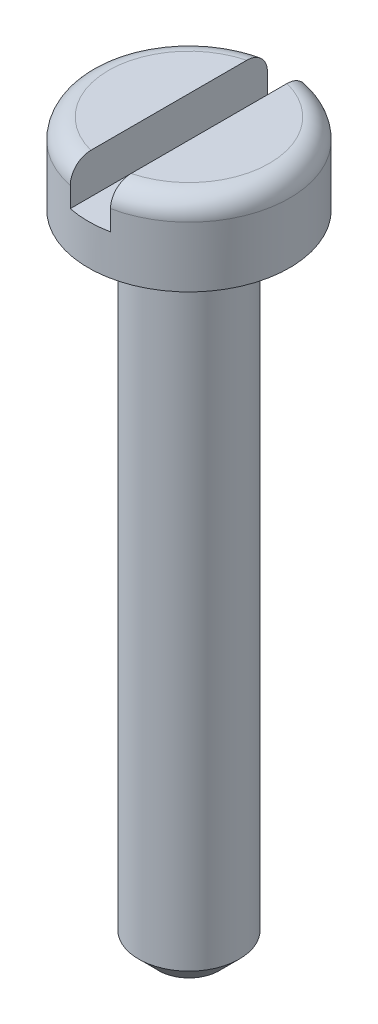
ISO-10303-21;
HEADER;
FILE_DESCRIPTION(('STEP AP214'),'2;1');
FILE_NAME('part.step','',(''),(''),'','','');
FILE_SCHEMA(('AUTOMOTIVE_DESIGN { 1 0 10303 214 1 1 1 1 }'));
ENDSEC;
DATA;
#1=APPLICATION_CONTEXT('core data for automotive mechanical design processes');
#2=APPLICATION_PROTOCOL_DEFINITION('international standard','automotive_design',2000,#1);
#3=PRODUCT_CONTEXT('',#1,'mechanical');
#4=PRODUCT('Part','Part','',(#3));
#5=PRODUCT_RELATED_PRODUCT_CATEGORY('part','',(#4));
#6=PRODUCT_DEFINITION_FORMATION('','',#4);
#7=PRODUCT_DEFINITION_CONTEXT('part definition',#1,'design');
#8=PRODUCT_DEFINITION('design','',#6,#7);
#9=PRODUCT_DEFINITION_SHAPE('','',#8);
#10=(LENGTH_UNIT() NAMED_UNIT(*) SI_UNIT(.MILLI.,.METRE.));
#11=(NAMED_UNIT(*) PLANE_ANGLE_UNIT() SI_UNIT($,.RADIAN.));
#12=(NAMED_UNIT(*) SI_UNIT($,.STERADIAN.) SOLID_ANGLE_UNIT());
#13=UNCERTAINTY_MEASURE_WITH_UNIT(LENGTH_MEASURE(1.E-05),#10,'distance_accuracy_value','');
#14=(GEOMETRIC_REPRESENTATION_CONTEXT(3) GLOBAL_UNCERTAINTY_ASSIGNED_CONTEXT((#13)) GLOBAL_UNIT_ASSIGNED_CONTEXT((#10,
#11,#12)) REPRESENTATION_CONTEXT('',''));
#15=CARTESIAN_POINT('',(0.,0.,0.));
#16=DIRECTION('',(0.,0.,1.));
#17=DIRECTION('',(1.,0.,0.));
#18=AXIS2_PLACEMENT_3D('',#15,#16,#17);
#19=CARTESIAN_POINT('',(0.,18.,0.));
#20=DIRECTION('',(0.,1.,0.));
#21=DIRECTION('',(0.,0.,1.));
#22=AXIS2_PLACEMENT_3D('',#19,#20,#21);
#23=PLANE('',#22);
#24=DIRECTION('',(0.,0.,-1.));
#25=VECTOR('',#24,1.);
#26=CARTESIAN_POINT('',(0.500000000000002,18.,0.));
#27=LINE('',#26,#25);
#28=CARTESIAN_POINT('',(0.500000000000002,18.,1.93649167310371));
#29=VERTEX_POINT('',#28);
#30=CARTESIAN_POINT('',(0.500000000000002,18.,-1.93649167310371));
#31=VERTEX_POINT('',#30);
#32=EDGE_CURVE('E143',#29,#31,#27,.T.);
#33=ORIENTED_EDGE('',*,*,#32,.F.);
#34=CARTESIAN_POINT('',(0.,18.,0.));
#35=DIRECTION('',(0.,-1.,0.));
#36=DIRECTION('',(0.,0.,-1.));
#37=AXIS2_PLACEMENT_3D('',#34,#35,#36);
#38=CIRCLE('',#37,2.);
#39=EDGE_CURVE('E124',#31,#29,#38,.T.);
#40=ORIENTED_EDGE('',*,*,#39,.F.);
#41=EDGE_LOOP('',(#33,#40));
#42=FACE_BOUND('',#41,.T.);
#43=ADVANCED_FACE('F41',(#42),#23,.T.);
#44=CARTESIAN_POINT('',(0.,17.5,0.));
#45=DIRECTION('',(0.,-1.,0.));
#46=DIRECTION('',(0.,0.,-1.));
#47=AXIS2_PLACEMENT_3D('',#44,#45,#46);
#48=TOROIDAL_SURFACE('',#47,2.,0.5);
#49=CARTESIAN_POINT('',(0.500000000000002,17.6513555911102,-2.42554244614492));
#50=CARTESIAN_POINT('',(0.500000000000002,17.6251453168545,-2.43404091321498));
#51=CARTESIAN_POINT('',(0.500000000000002,17.5982013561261,-2.44033899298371));
#52=CARTESIAN_POINT('',(0.500000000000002,17.5436171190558,-2.44832431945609));
#53=CARTESIAN_POINT('',(0.500000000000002,17.5159761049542,-2.45000645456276));
#54=CARTESIAN_POINT('',(0.500000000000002,17.4608140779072,-2.44869809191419));
#55=CARTESIAN_POINT('',(0.500000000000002,17.4332930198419,-2.44570953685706));
#56=CARTESIAN_POINT('',(0.500000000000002,17.3791505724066,-2.43515649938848));
#57=CARTESIAN_POINT('',(0.500000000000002,17.3525289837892,-2.42759303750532));
#58=CARTESIAN_POINT('',(0.500000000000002,17.3009074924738,-2.40811846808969));
#59=CARTESIAN_POINT('',(0.500000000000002,17.2759086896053,-2.39620444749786));
#60=CARTESIAN_POINT('',(0.500000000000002,17.228236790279,-2.36839135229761));
#61=CARTESIAN_POINT('',(0.500000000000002,17.2055638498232,-2.35249201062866));
#62=CARTESIAN_POINT('',(0.500000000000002,17.1629136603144,-2.31698765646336));
#63=CARTESIAN_POINT('',(0.500000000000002,17.1429684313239,-2.29734420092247));
#64=CARTESIAN_POINT('',(0.500000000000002,17.1065821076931,-2.25504509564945));
#65=CARTESIAN_POINT('',(0.500000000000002,17.090141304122,-2.23238919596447));
#66=CARTESIAN_POINT('',(0.500000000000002,17.0608734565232,-2.18423384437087));
#67=CARTESIAN_POINT('',(0.500000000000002,17.0481246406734,-2.15868686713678));
#68=CARTESIAN_POINT('',(0.500000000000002,17.0269779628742,-2.10585286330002));
#69=CARTESIAN_POINT('',(0.500000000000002,17.0185806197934,-2.0785656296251));
#70=CARTESIAN_POINT('',(0.500000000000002,17.0061505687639,-2.02229237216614));
#71=CARTESIAN_POINT('',(0.500000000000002,17.0022332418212,-1.99328086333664));
#72=CARTESIAN_POINT('',(0.500000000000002,16.9992028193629,-1.93500802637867));
#73=CARTESIAN_POINT('',(0.500000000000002,17.0000903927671,-1.90574666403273));
#74=CARTESIAN_POINT('',(0.500000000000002,17.0066876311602,-1.84706981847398));
#75=CARTESIAN_POINT('',(0.500000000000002,17.0125109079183,-1.81766707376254));
#76=CARTESIAN_POINT('',(0.500000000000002,17.0289558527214,-1.76023287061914));
#77=CARTESIAN_POINT('',(0.500000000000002,17.03957807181,-1.73220157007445));
#78=CARTESIAN_POINT('',(0.500000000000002,17.0654836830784,-1.67801317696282));
#79=CARTESIAN_POINT('',(0.500000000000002,17.0808151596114,-1.65187902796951));
#80=CARTESIAN_POINT('',(0.500000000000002,17.1157152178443,-1.60260565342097));
#81=CARTESIAN_POINT('',(0.500000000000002,17.1352837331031,-1.57946638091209));
#82=CARTESIAN_POINT('',(0.500000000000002,17.1778084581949,-1.5372947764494));
#83=CARTESIAN_POINT('',(0.500000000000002,17.2007043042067,-1.51820169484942));
#84=CARTESIAN_POINT('',(0.500000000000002,17.2495050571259,-1.48434893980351));
#85=CARTESIAN_POINT('',(0.500000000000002,17.2754090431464,-1.46958794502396));
#86=CARTESIAN_POINT('',(0.500000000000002,17.3282283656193,-1.44556869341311));
#87=CARTESIAN_POINT('',(0.500000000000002,17.3550431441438,-1.4360894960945));
#88=CARTESIAN_POINT('',(0.500000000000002,17.4099262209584,-1.42203172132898));
#89=CARTESIAN_POINT('',(0.500000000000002,17.4379940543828,-1.41745134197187));
#90=CARTESIAN_POINT('',(0.500000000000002,17.4931051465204,-1.41349529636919));
#91=CARTESIAN_POINT('',(0.500000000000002,17.5201311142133,-1.4138753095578));
#92=CARTESIAN_POINT('',(0.500000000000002,17.5737207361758,-1.41923295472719));
#93=CARTESIAN_POINT('',(0.500000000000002,17.6002844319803,-1.42421017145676));
#94=CARTESIAN_POINT('',(0.500000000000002,17.6518652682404,-1.43846589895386));
#95=CARTESIAN_POINT('',(0.500000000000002,17.6768976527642,-1.44768955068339));
#96=CARTESIAN_POINT('',(0.500000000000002,17.7251311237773,-1.47007613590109));
#97=CARTESIAN_POINT('',(0.500000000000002,17.7483319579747,-1.48323961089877));
#98=CARTESIAN_POINT('',(0.500000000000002,17.7930866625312,-1.51356498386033));
#99=CARTESIAN_POINT('',(0.500000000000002,17.8145603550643,-1.53084504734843));
#100=CARTESIAN_POINT('',(0.500000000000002,17.8544807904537,-1.56860345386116));
#101=CARTESIAN_POINT('',(0.500000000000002,17.8729268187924,-1.58908254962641));
#102=CARTESIAN_POINT('',(0.500000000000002,17.9072539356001,-1.63378495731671));
#103=CARTESIAN_POINT('',(0.500000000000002,17.9229554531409,-1.65814624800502));
#104=CARTESIAN_POINT('',(0.500000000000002,17.9502153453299,-1.70908672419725));
#105=CARTESIAN_POINT('',(0.500000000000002,17.9617728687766,-1.73566636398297));
#106=CARTESIAN_POINT('',(0.500000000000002,17.9808087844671,-1.79133272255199));
#107=CARTESIAN_POINT('',(0.500000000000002,17.9881238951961,-1.82047542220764));
#108=CARTESIAN_POINT('',(0.500000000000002,17.9977993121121,-1.87957393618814));
#109=CARTESIAN_POINT('',(0.500000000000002,18.0001592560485,-1.90952980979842));
#110=CARTESIAN_POINT('',(0.500000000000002,17.9998228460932,-1.96963605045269));
#111=CARTESIAN_POINT('',(0.500000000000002,17.9970893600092,-1.99978623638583));
#112=CARTESIAN_POINT('',(0.500000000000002,17.9865160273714,-2.05917846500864));
#113=CARTESIAN_POINT('',(0.500000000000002,17.9786767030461,-2.08842060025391));
#114=CARTESIAN_POINT('',(0.500000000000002,17.9582254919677,-2.14465744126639));
#115=CARTESIAN_POINT('',(0.500000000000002,17.9456919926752,-2.17168062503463));
#116=CARTESIAN_POINT('',(0.500000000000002,17.9161464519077,-2.22316837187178));
#117=CARTESIAN_POINT('',(0.500000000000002,17.8991338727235,-2.24763262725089));
#118=CARTESIAN_POINT('',(0.500000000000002,17.8615769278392,-2.29263724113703));
#119=CARTESIAN_POINT('',(0.500000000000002,17.8411322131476,-2.31326085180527));
#120=CARTESIAN_POINT('',(0.500000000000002,17.7970099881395,-2.35065625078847));
#121=CARTESIAN_POINT('',(0.500000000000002,17.7733370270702,-2.3674333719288));
#122=CARTESIAN_POINT('',(0.500000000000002,17.7330711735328,-2.39098922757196));
#123=CARTESIAN_POINT('',(0.500000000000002,17.7172595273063,-2.39913103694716));
#124=CARTESIAN_POINT('',(0.500000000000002,17.6848521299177,-2.41366766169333));
#125=CARTESIAN_POINT('',(0.500000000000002,17.6682563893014,-2.42006250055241));
#126=CARTESIAN_POINT('',(0.500000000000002,17.6513555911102,-2.42554244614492));
#127=B_SPLINE_CURVE_WITH_KNOTS('',3,(#49,#50,#51,#52,#53,#54,#55,#56,#57,#58,#59,#60,#61,#62,
#63,#64,#65,#66,#67,#68,#69,#70,#71,#72,#73,#74,#75,#76,#77,#78,#79,#80,#81,#82,#83,#84,#85,#86,
#87,#88,#89,#90,#91,#92,#93,#94,#95,#96,#97,#98,#99,#100,#101,#102,#103,#104,#105,#106,#107,
#108,#109,#110,#111,#112,#113,#114,#115,#116,#117,#118,#119,#120,#121,#122,#123,#124,#125,#126),
.UNSPECIFIED.,.T.,.F.,(4,2,2,2,2,2,2,2,2,2,2,2,2,2,2,2,2,2,2,2,2,2,2,2,2,2,2,2,2,2,2,2,2,2,2,2,
2,2,4),(0.,0.0825962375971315,0.165283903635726,0.247937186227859,0.330572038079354,
0.413262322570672,0.495958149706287,0.579553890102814,0.66315657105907,0.748419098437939,
0.833691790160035,0.921114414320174,1.00854920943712,1.09805303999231,1.18756715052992,
1.27802747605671,1.36848638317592,1.4574720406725,1.54643052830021,1.63131732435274,
1.71617288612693,1.79686540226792,1.87755063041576,1.95722154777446,2.03690342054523,
2.11922887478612,2.20157372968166,2.28813262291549,2.37470928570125,2.46442832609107,
2.55415392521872,2.64453620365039,2.73490923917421,2.82383595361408,2.91277334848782,
2.99947263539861,3.08605098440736,3.13931105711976,3.19257041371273),.UNSPECIFIED.);
#128=CARTESIAN_POINT('',(0.500000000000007,17.5,-2.44948974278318));
#129=VERTEX_POINT('',#128);
#130=EDGE_CURVE('E159',#31,#129,#127,.T.);
#131=ORIENTED_EDGE('',*,*,#130,.F.);
#132=ORIENTED_EDGE('',*,*,#39,.T.);
#133=CARTESIAN_POINT('',(0.500000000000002,17.6189418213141,1.42942839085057));
#134=CARTESIAN_POINT('',(0.500000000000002,17.5931610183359,1.42274049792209));
#135=CARTESIAN_POINT('',(0.500000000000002,17.5668035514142,1.41820976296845));
#136=CARTESIAN_POINT('',(0.500000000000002,17.5136858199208,1.41365847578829));
#137=CARTESIAN_POINT('',(0.500000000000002,17.4869252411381,1.41364164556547));
#138=CARTESIAN_POINT('',(0.500000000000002,17.4338001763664,1.41812335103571));
#139=CARTESIAN_POINT('',(0.500000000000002,17.4074354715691,1.42261929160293));
#140=CARTESIAN_POINT('',(0.500000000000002,17.3558307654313,1.43593989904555));
#141=CARTESIAN_POINT('',(0.500000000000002,17.330590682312,1.44476425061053));
#142=CARTESIAN_POINT('',(0.500000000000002,17.2816932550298,1.46649754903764));
#143=CARTESIAN_POINT('',(0.500000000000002,17.2580505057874,1.47943923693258));
#144=CARTESIAN_POINT('',(0.500000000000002,17.2131448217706,1.50894112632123));
#145=CARTESIAN_POINT('',(0.500000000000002,17.1918823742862,1.52550206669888));
#146=CARTESIAN_POINT('',(0.500000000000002,17.1512964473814,1.56257318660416));
#147=CARTESIAN_POINT('',(0.500000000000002,17.1321066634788,1.58322968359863));
#148=CARTESIAN_POINT('',(0.500000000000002,17.0972742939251,1.62734311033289));
#149=CARTESIAN_POINT('',(0.500000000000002,17.0816325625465,1.65080071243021));
#150=CARTESIAN_POINT('',(0.500000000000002,17.0535847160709,1.70105988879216));
#151=CARTESIAN_POINT('',(0.500000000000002,17.0413685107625,1.72796759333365));
#152=CARTESIAN_POINT('',(0.500000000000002,17.0215061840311,1.78342124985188));
#153=CARTESIAN_POINT('',(0.500000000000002,17.0138607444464,1.81196744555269));
#154=CARTESIAN_POINT('',(0.500000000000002,17.0032240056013,1.87061301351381));
#155=CARTESIAN_POINT('',(0.500000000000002,17.0003465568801,1.90073313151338));
#156=CARTESIAN_POINT('',(0.500000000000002,16.999712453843,1.96102931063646));
#157=CARTESIAN_POINT('',(0.500000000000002,17.0019558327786,1.99120537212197));
#158=CARTESIAN_POINT('',(0.500000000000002,17.0115295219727,2.05059786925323));
#159=CARTESIAN_POINT('',(0.500000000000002,17.0188360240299,2.07981812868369));
#160=CARTESIAN_POINT('',(0.500000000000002,17.038361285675,2.13657054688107));
#161=CARTESIAN_POINT('',(0.500000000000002,17.0505795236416,2.16410288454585));
#162=CARTESIAN_POINT('',(0.500000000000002,17.0793048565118,2.21604366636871));
#163=CARTESIAN_POINT('',(0.500000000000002,17.095711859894,2.24050744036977));
#164=CARTESIAN_POINT('',(0.500000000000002,17.1325028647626,2.28623679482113));
#165=CARTESIAN_POINT('',(0.500000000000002,17.1528862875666,2.30750283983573));
#166=CARTESIAN_POINT('',(0.500000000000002,17.1964758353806,2.34564438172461));
#167=CARTESIAN_POINT('',(0.500000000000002,17.2195943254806,2.36262005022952));
#168=CARTESIAN_POINT('',(0.500000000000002,17.2684036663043,2.39234871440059));
#169=CARTESIAN_POINT('',(0.500000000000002,17.2940941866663,2.40510225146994));
#170=CARTESIAN_POINT('',(0.500000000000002,17.3467238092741,2.4257496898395));
#171=CARTESIAN_POINT('',(0.500000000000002,17.3736244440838,2.43374171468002));
#172=CARTESIAN_POINT('',(0.500000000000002,17.4283928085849,2.44503342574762));
#173=CARTESIAN_POINT('',(0.500000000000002,17.4562604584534,2.44833349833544));
#174=CARTESIAN_POINT('',(0.500000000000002,17.5118069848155,2.45012555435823));
#175=CARTESIAN_POINT('',(0.500000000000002,17.5394839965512,2.44867589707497));
#176=CARTESIAN_POINT('',(0.500000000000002,17.5941990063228,2.44114230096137));
#177=CARTESIAN_POINT('',(0.500000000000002,17.6212370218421,2.4350584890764));
#178=CARTESIAN_POINT('',(0.500000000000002,17.6738704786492,2.41845817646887));
#179=CARTESIAN_POINT('',(0.500000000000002,17.6994680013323,2.40794826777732));
#180=CARTESIAN_POINT('',(0.500000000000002,17.7485572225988,2.38281792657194));
#181=CARTESIAN_POINT('',(0.500000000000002,17.7720488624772,2.36819737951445));
#182=CARTESIAN_POINT('',(0.500000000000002,17.8165017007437,2.335130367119));
#183=CARTESIAN_POINT('',(0.500000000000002,17.8374375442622,2.31664983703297));
#184=CARTESIAN_POINT('',(0.500000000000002,17.8759779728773,2.27649378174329));
#185=CARTESIAN_POINT('',(0.500000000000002,17.8935823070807,2.25481801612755));
#186=CARTESIAN_POINT('',(0.500000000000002,17.9253182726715,2.20846407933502));
#187=CARTESIAN_POINT('',(0.500000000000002,17.9393793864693,2.18373765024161));
#188=CARTESIAN_POINT('',(0.500000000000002,17.9632646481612,2.13231806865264));
#189=CARTESIAN_POINT('',(0.500000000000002,17.9730882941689,2.10562468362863));
#190=CARTESIAN_POINT('',(0.500000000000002,17.9884795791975,2.05032684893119));
#191=CARTESIAN_POINT('',(0.500000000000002,17.993936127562,2.02169148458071));
#192=CARTESIAN_POINT('',(0.500000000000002,18.0000899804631,1.96391417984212));
#193=CARTESIAN_POINT('',(0.500000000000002,18.0007866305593,1.93477217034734));
#194=CARTESIAN_POINT('',(0.500000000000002,17.9974023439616,1.87604638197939));
#195=CARTESIAN_POINT('',(0.500000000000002,17.9932034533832,1.84646937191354));
#196=CARTESIAN_POINT('',(0.500000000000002,17.9799712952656,1.78841624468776));
#197=CARTESIAN_POINT('',(0.500000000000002,17.9709376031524,1.75994022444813));
#198=CARTESIAN_POINT('',(0.500000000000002,17.9481208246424,1.7045019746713));
#199=CARTESIAN_POINT('',(0.500000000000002,17.9342748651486,1.67756557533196));
#200=CARTESIAN_POINT('',(0.500000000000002,17.9022060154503,1.62642153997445));
#201=CARTESIAN_POINT('',(0.500000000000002,17.8839819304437,1.60221465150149));
#202=CARTESIAN_POINT('',(0.500000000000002,17.8438367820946,1.5575516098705));
#203=CARTESIAN_POINT('',(0.500000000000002,17.8219570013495,1.5370583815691));
#204=CARTESIAN_POINT('',(0.500000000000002,17.7749553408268,1.50025028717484));
#205=CARTESIAN_POINT('',(0.500000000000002,17.74983855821,1.48392896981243));
#206=CARTESIAN_POINT('',(0.500000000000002,17.7069050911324,1.46126815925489));
#207=CARTESIAN_POINT('',(0.500000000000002,17.6898420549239,1.45347281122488));
#208=CARTESIAN_POINT('',(0.500000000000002,17.6549283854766,1.43990533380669));
#209=CARTESIAN_POINT('',(0.500000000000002,17.6370777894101,1.43413310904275));
#210=CARTESIAN_POINT('',(0.500000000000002,17.6189418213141,1.42942839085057));
#211=B_SPLINE_CURVE_WITH_KNOTS('',3,(#133,#134,#135,#136,#137,#138,#139,#140,#141,#142,#143,
#144,#145,#146,#147,#148,#149,#150,#151,#152,#153,#154,#155,#156,#157,#158,#159,#160,#161,#162,
#163,#164,#165,#166,#167,#168,#169,#170,#171,#172,#173,#174,#175,#176,#177,#178,#179,#180,#181,
#182,#183,#184,#185,#186,#187,#188,#189,#190,#191,#192,#193,#194,#195,#196,#197,#198,#199,#200,
#201,#202,#203,#204,#205,#206,#207,#208,#209,#210),.UNSPECIFIED.,.T.,.F.,(4,2,2,2,2,2,2,2,2,2,2,
2,2,2,2,2,2,2,2,2,2,2,2,2,2,2,2,2,2,2,2,2,2,2,2,2,2,2,4),(0.,0.0798347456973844,
0.159735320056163,0.239589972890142,0.319438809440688,0.3999391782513,0.480455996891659,
0.564666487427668,0.64889723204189,0.737145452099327,0.82540683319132,0.915746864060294,
1.00608748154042,1.09600614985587,1.18591527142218,1.27384968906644,1.36177131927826,
1.44739645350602,1.53301060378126,1.61679324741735,1.70056899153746,1.78331927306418,
1.86606728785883,1.94869249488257,2.03132000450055,2.11471009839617,2.19810646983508,
2.28305067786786,2.368004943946,2.45505711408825,2.54212125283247,2.63132723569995,
2.72054105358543,2.81096723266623,2.90141811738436,2.99090918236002,3.08026101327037,
3.13642484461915,3.19258602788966),.UNSPECIFIED.);
#212=CARTESIAN_POINT('',(0.500000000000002,17.5,2.44948974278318));
#213=VERTEX_POINT('',#212);
#214=EDGE_CURVE('E136',#213,#29,#211,.T.);
#215=ORIENTED_EDGE('',*,*,#214,.F.);
#216=CARTESIAN_POINT('',(0.,17.5,0.));
#217=DIRECTION('',(0.,-1.,0.));
#218=DIRECTION('',(0.,0.,-1.));
#219=AXIS2_PLACEMENT_3D('',#216,#217,#218);
#220=CIRCLE('',#219,2.5);
#221=EDGE_CURVE('E129',#129,#213,#220,.T.);
#222=ORIENTED_EDGE('',*,*,#221,.F.);
#223=EDGE_LOOP('',(#131,#132,#215,#222));
#224=FACE_BOUND('',#223,.T.);
#225=ADVANCED_FACE('F191',(#224),#48,.T.);
#226=CARTESIAN_POINT('',(0.,0.,-1.25));
#227=DIRECTION('',(0.,-1.,0.));
#228=DIRECTION('',(0.,0.,-1.));
#229=AXIS2_PLACEMENT_3D('',#226,#227,#228);
#230=PLANE('',#229);
#231=CARTESIAN_POINT('',(0.,0.,0.));
#232=DIRECTION('',(0.,-1.,0.));
#233=DIRECTION('',(0.,0.,-1.));
#234=AXIS2_PLACEMENT_3D('',#231,#232,#233);
#235=CIRCLE('',#234,0.750000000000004);
#236=CARTESIAN_POINT('',(0.,0.,-0.750000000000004));
#237=VERTEX_POINT('',#236);
#238=EDGE_CURVE('E49',#237,#237,#235,.T.);
#239=ORIENTED_EDGE('',*,*,#238,.T.);
#240=EDGE_LOOP('',(#239));
#241=FACE_BOUND('',#240,.T.);
#242=ADVANCED_FACE('F186',(#241),#230,.T.);
#243=DIRECTION('',(0.,0.,1.));
#244=VECTOR('',#243,1.);
#245=CARTESIAN_POINT('',(-0.499999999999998,18.,0.));
#246=LINE('',#245,#244);
#247=CARTESIAN_POINT('',(-0.499999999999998,18.,-1.93649167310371));
#248=VERTEX_POINT('',#247);
#249=CARTESIAN_POINT('',(-0.499999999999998,18.,1.93649167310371));
#250=VERTEX_POINT('',#249);
#251=EDGE_CURVE('E169',#248,#250,#246,.T.);
#252=ORIENTED_EDGE('',*,*,#251,.F.);
#253=EDGE_CURVE('E127',#250,#248,#38,.T.);
#254=ORIENTED_EDGE('',*,*,#253,.F.);
#255=EDGE_LOOP('',(#252,#254));
#256=FACE_BOUND('',#255,.T.);
#257=ADVANCED_FACE('F184',(#256),#23,.T.);
#258=CARTESIAN_POINT('',(-0.499999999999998,17.6513555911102,-2.42554244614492));
#259=CARTESIAN_POINT('',(-0.499999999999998,17.6779604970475,-2.41691326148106));
#260=CARTESIAN_POINT('',(-0.499999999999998,17.7038492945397,-2.40600355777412));
#261=CARTESIAN_POINT('',(-0.499999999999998,17.7534356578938,-2.3799605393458));
#262=CARTESIAN_POINT('',(-0.499999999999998,17.7771302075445,-2.36482152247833));
#263=CARTESIAN_POINT('',(-0.499999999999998,17.8216230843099,-2.33081077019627));
#264=CARTESIAN_POINT('',(-0.499999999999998,17.8424249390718,-2.3119436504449));
#265=CARTESIAN_POINT('',(-0.499999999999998,17.8806119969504,-2.2710349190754));
#266=CARTESIAN_POINT('',(-0.499999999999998,17.8979980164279,-2.24899406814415));
#267=CARTESIAN_POINT('',(-0.499999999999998,17.9291508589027,-2.2020382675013));
#268=CARTESIAN_POINT('',(-0.499999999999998,17.9428630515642,-2.17708709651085));
#269=CARTESIAN_POINT('',(-0.499999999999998,17.9660199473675,-2.12527750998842));
#270=CARTESIAN_POINT('',(-0.499999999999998,17.9754639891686,-2.09841879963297));
#271=CARTESIAN_POINT('',(-0.499999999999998,17.9900668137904,-2.04284531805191));
#272=CARTESIAN_POINT('',(-0.499999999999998,17.9951130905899,-2.0141009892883));
#273=CARTESIAN_POINT('',(-0.499999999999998,18.0004331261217,-1.95617429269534));
#274=CARTESIAN_POINT('',(-0.499999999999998,18.0007062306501,-1.92699186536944));
#275=CARTESIAN_POINT('',(-0.499999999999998,17.9964614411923,-1.86826143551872));
#276=CARTESIAN_POINT('',(-0.499999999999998,17.9918266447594,-1.83872185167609));
#277=CARTESIAN_POINT('',(-0.499999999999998,17.977730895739,-1.78081534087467));
#278=CARTESIAN_POINT('',(-0.499999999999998,17.9682693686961,-1.75244855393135));
#279=CARTESIAN_POINT('',(-0.499999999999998,17.9446164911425,-1.69732230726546));
#280=CARTESIAN_POINT('',(-0.499999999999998,17.9303656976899,-1.67058830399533));
#281=CARTESIAN_POINT('',(-0.499999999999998,17.8975257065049,-1.61992661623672));
#282=CARTESIAN_POINT('',(-0.499999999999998,17.8789364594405,-1.59599896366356));
#283=CARTESIAN_POINT('',(-0.499999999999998,17.8381466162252,-1.55199874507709));
#284=CARTESIAN_POINT('',(-0.499999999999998,17.8159940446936,-1.53188174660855));
#285=CARTESIAN_POINT('',(-0.499999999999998,17.768496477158,-1.49585115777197));
#286=CARTESIAN_POINT('',(-0.499999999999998,17.743152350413,-1.47993642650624));
#287=CARTESIAN_POINT('',(-0.499999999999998,17.6911443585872,-1.45352942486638));
#288=CARTESIAN_POINT('',(-0.499999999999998,17.6645840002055,-1.44283353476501));
#289=CARTESIAN_POINT('',(-0.499999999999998,17.6099878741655,-1.42632621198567));
#290=CARTESIAN_POINT('',(-0.499999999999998,17.5819526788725,-1.4205128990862));
#291=CARTESIAN_POINT('',(-0.499999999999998,17.5267405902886,-1.41419640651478));
#292=CARTESIAN_POINT('',(-0.499999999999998,17.4995926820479,-1.41343791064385));
#293=CARTESIAN_POINT('',(-0.499999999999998,17.4455711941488,-1.41658506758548));
#294=CARTESIAN_POINT('',(-0.499999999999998,17.4186975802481,-1.42049013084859));
#295=CARTESIAN_POINT('',(-0.499999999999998,17.3664917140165,-1.43268529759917));
#296=CARTESIAN_POINT('',(-0.499999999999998,17.3411402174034,-1.44089354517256));
#297=CARTESIAN_POINT('',(-0.499999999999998,17.2921175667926,-1.4613330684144));
#298=CARTESIAN_POINT('',(-0.499999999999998,17.2684466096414,-1.47356481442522));
#299=CARTESIAN_POINT('',(-0.499999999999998,17.2227080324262,-1.50203777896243));
#300=CARTESIAN_POINT('',(-0.499999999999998,17.2007057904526,-1.5183838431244));
#301=CARTESIAN_POINT('',(-0.499999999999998,17.1595873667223,-1.55437114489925));
#302=CARTESIAN_POINT('',(-0.499999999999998,17.1404718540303,-1.57401314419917));
#303=CARTESIAN_POINT('',(-0.499999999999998,17.1046462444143,-1.61710863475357));
#304=CARTESIAN_POINT('',(-0.499999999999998,17.0881083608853,-1.64070534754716));
#305=CARTESIAN_POINT('',(-0.499999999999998,17.059050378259,-1.69025542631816));
#306=CARTESIAN_POINT('',(-0.499999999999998,17.046531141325,-1.71620929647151));
#307=CARTESIAN_POINT('',(-0.499999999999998,17.0253938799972,-1.77084081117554));
#308=CARTESIAN_POINT('',(-0.499999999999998,17.0169485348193,-1.79958541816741));
#309=CARTESIAN_POINT('',(-0.499999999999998,17.0049437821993,-1.85807915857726));
#310=CARTESIAN_POINT('',(-0.499999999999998,17.0013848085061,-1.88782838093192));
#311=CARTESIAN_POINT('',(-0.499999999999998,16.9992680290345,-1.94782921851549));
#312=CARTESIAN_POINT('',(-0.499999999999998,17.0007645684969,-1.97808279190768));
#313=CARTESIAN_POINT('',(-0.499999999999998,17.0088881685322,-2.03789526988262));
#314=CARTESIAN_POINT('',(-0.499999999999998,17.015514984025,-2.06745420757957));
#315=CARTESIAN_POINT('',(-0.499999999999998,17.0336407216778,-2.12459213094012));
#316=CARTESIAN_POINT('',(-0.499999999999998,17.0450711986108,-2.15219279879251));
#317=CARTESIAN_POINT('',(-0.499999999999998,17.0725203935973,-2.20501148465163));
#318=CARTESIAN_POINT('',(-0.499999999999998,17.0885385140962,-2.23022981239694));
#319=CARTESIAN_POINT('',(-0.499999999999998,17.1242785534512,-2.27688718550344));
#320=CARTESIAN_POINT('',(-0.499999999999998,17.1438972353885,-2.29840530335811));
#321=CARTESIAN_POINT('',(-0.499999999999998,17.1865501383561,-2.33773708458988));
#322=CARTESIAN_POINT('',(-0.499999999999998,17.209583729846,-2.35555142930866));
#323=CARTESIAN_POINT('',(-0.499999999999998,17.2577891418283,-2.38650628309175));
#324=CARTESIAN_POINT('',(-0.499999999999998,17.2828931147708,-2.39975249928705));
#325=CARTESIAN_POINT('',(-0.499999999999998,17.3350048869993,-2.421757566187));
#326=CARTESIAN_POINT('',(-0.499999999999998,17.3620129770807,-2.43051572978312));
#327=CARTESIAN_POINT('',(-0.499999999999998,17.4166512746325,-2.44314746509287));
#328=CARTESIAN_POINT('',(-0.499999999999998,17.4442626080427,-2.44710300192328));
#329=CARTESIAN_POINT('',(-0.499999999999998,17.4997314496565,-2.45027454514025));
#330=CARTESIAN_POINT('',(-0.499999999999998,17.5275885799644,-2.44949687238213));
#331=CARTESIAN_POINT('',(-0.499999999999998,17.5714906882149,-2.44452556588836));
#332=CARTESIAN_POINT('',(-0.499999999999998,17.5877226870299,-2.44185328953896));
#333=CARTESIAN_POINT('',(-0.499999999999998,17.619837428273,-2.43489736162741));
#334=CARTESIAN_POINT('',(-0.499999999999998,17.6357201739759,-2.43061372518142));
#335=CARTESIAN_POINT('',(-0.499999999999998,17.6513555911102,-2.42554244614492));
#336=B_SPLINE_CURVE_WITH_KNOTS('',3,(#258,#259,#260,#261,#262,#263,#264,#265,#266,#267,#268,
#269,#270,#271,#272,#273,#274,#275,#276,#277,#278,#279,#280,#281,#282,#283,#284,#285,#286,#287,
#288,#289,#290,#291,#292,#293,#294,#295,#296,#297,#298,#299,#300,#301,#302,#303,#304,#305,#306,
#307,#308,#309,#310,#311,#312,#313,#314,#315,#316,#317,#318,#319,#320,#321,#322,#323,#324,#325,
#326,#327,#328,#329,#330,#331,#332,#333,#334,#335),.UNSPECIFIED.,.T.,.F.,(4,2,2,2,2,2,2,2,2,2,2,
2,2,2,2,2,2,2,2,2,2,2,2,2,2,2,2,2,2,2,2,2,2,2,2,2,2,2,4),(0.,0.0838467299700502,
0.167807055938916,0.251664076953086,0.33550103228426,0.420523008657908,0.505558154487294,
0.592709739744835,0.679873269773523,0.76916067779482,0.858458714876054,0.948908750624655,
1.03935981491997,1.12868072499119,1.21797735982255,1.30343687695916,1.3888634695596,
1.469940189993,1.5510066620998,1.63058421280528,1.71017106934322,1.79203843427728,
1.87392474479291,1.95998382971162,2.04606136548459,2.13552220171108,2.22499097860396,
2.31542456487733,2.40585383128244,2.49503610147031,2.5842067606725,2.67113567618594,
2.75804858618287,2.84278878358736,2.9275419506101,3.0108273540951,3.09400156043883,
3.1432778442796,3.1925536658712),.UNSPECIFIED.);
#337=CARTESIAN_POINT('',(-0.499999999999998,17.5000000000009,-2.44948974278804));
#338=VERTEX_POINT('',#337);
#339=EDGE_CURVE('E164',#338,#248,#336,.T.);
#340=ORIENTED_EDGE('',*,*,#339,.F.);
#341=CARTESIAN_POINT('',(-0.499999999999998,17.5,2.44948974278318));
#342=VERTEX_POINT('',#341);
#343=EDGE_CURVE('E117',#342,#338,#220,.T.);
#344=ORIENTED_EDGE('',*,*,#343,.F.);
#345=CARTESIAN_POINT('',(-0.499999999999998,17.6189418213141,1.42942839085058));
#346=CARTESIAN_POINT('',(-0.499999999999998,17.6459100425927,1.43642736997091));
#347=CARTESIAN_POINT('',(-0.499999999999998,17.6722886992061,1.44579852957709));
#348=CARTESIAN_POINT('',(-0.499999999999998,17.7230869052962,1.4689093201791));
#349=CARTESIAN_POINT('',(-0.499999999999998,17.7475030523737,1.48265634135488));
#350=CARTESIAN_POINT('',(-0.499999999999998,17.7936508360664,1.51396906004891));
#351=CARTESIAN_POINT('',(-0.499999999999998,17.8153893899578,1.53152457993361));
#352=CARTESIAN_POINT('',(-0.499999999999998,17.8557389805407,1.56990371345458));
#353=CARTESIAN_POINT('',(-0.499999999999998,17.8743506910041,1.59072662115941));
#354=CARTESIAN_POINT('',(-0.499999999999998,17.9086879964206,1.63589093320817));
#355=CARTESIAN_POINT('',(-0.499999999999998,17.924277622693,1.66033571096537));
#356=CARTESIAN_POINT('',(-0.499999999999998,17.9513021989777,1.71142528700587));
#357=CARTESIAN_POINT('',(-0.499999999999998,17.9627361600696,1.73807060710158));
#358=CARTESIAN_POINT('',(-0.499999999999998,17.9815092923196,1.7938482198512));
#359=CARTESIAN_POINT('',(-0.499999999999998,17.9886850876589,1.82303564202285));
#360=CARTESIAN_POINT('',(-0.499999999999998,17.9980741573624,1.88220004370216));
#361=CARTESIAN_POINT('',(-0.499999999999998,18.0002870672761,1.91217708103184));
#362=CARTESIAN_POINT('',(-0.499999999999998,17.9996511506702,1.97228726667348));
#363=CARTESIAN_POINT('',(-0.499999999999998,17.9967674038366,2.00242007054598));
#364=CARTESIAN_POINT('',(-0.499999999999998,17.9858973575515,2.06175279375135));
#365=CARTESIAN_POINT('',(-0.499999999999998,17.9779114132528,2.09095277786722));
#366=CARTESIAN_POINT('',(-0.499999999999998,17.9571783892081,2.1470770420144));
#367=CARTESIAN_POINT('',(-0.499999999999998,17.9445102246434,2.17403044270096));
#368=CARTESIAN_POINT('',(-0.499999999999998,17.9147132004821,2.22534898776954));
#369=CARTESIAN_POINT('',(-0.499999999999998,17.8975849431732,2.24971448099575));
#370=CARTESIAN_POINT('',(-0.499999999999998,17.859826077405,2.29449498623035));
#371=CARTESIAN_POINT('',(-0.499999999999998,17.8392967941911,2.31499543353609));
#372=CARTESIAN_POINT('',(-0.499999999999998,17.7950130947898,2.35215380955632));
#373=CARTESIAN_POINT('',(-0.499999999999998,17.7712591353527,2.36881228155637));
#374=CARTESIAN_POINT('',(-0.499999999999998,17.7218238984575,2.3973947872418));
#375=CARTESIAN_POINT('',(-0.499999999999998,17.6962032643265,2.40942375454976));
#376=CARTESIAN_POINT('',(-0.499999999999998,17.6432833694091,2.42892677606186));
#377=CARTESIAN_POINT('',(-0.499999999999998,17.6159842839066,2.43640130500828));
#378=CARTESIAN_POINT('',(-0.499999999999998,17.5609693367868,2.44647100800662));
#379=CARTESIAN_POINT('',(-0.499999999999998,17.5332678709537,2.44914496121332));
#380=CARTESIAN_POINT('',(-0.499999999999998,17.4778122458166,2.44977187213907));
#381=CARTESIAN_POINT('',(-0.499999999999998,17.4500580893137,2.44772507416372));
#382=CARTESIAN_POINT('',(-0.499999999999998,17.3954665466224,2.43900293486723));
#383=CARTESIAN_POINT('',(-0.499999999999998,17.3686245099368,2.43235664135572));
#384=CARTESIAN_POINT('',(-0.499999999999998,17.3164298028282,2.4146720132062));
#385=CARTESIAN_POINT('',(-0.499999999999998,17.2910771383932,2.40363366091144));
#386=CARTESIAN_POINT('',(-0.499999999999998,17.2424457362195,2.37743999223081));
#387=CARTESIAN_POINT('',(-0.499999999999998,17.2191771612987,2.36226582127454));
#388=CARTESIAN_POINT('',(-0.499999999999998,17.1754710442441,2.32827930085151));
#389=CARTESIAN_POINT('',(-0.499999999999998,17.1550336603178,2.3094667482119));
#390=CARTESIAN_POINT('',(-0.499999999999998,17.1172374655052,2.26845102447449));
#391=CARTESIAN_POINT('',(-0.499999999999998,17.099928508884,2.24620193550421));
#392=CARTESIAN_POINT('',(-0.499999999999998,17.0691955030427,2.19916712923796));
#393=CARTESIAN_POINT('',(-0.499999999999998,17.0557718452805,2.17438115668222));
#394=CARTESIAN_POINT('',(-0.499999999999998,17.0328614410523,2.12238244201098));
#395=CARTESIAN_POINT('',(-0.499999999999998,17.0234703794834,2.09512755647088));
#396=CARTESIAN_POINT('',(-0.499999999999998,17.0092703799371,2.03945013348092));
#397=CARTESIAN_POINT('',(-0.499999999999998,17.0044620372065,2.0110274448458));
#398=CARTESIAN_POINT('',(-0.499999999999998,16.9994401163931,1.95304352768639));
#399=CARTESIAN_POINT('',(-0.499999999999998,16.999347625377,1.92347180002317));
#400=CARTESIAN_POINT('',(-0.499999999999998,17.0040239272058,1.86471436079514));
#401=CARTESIAN_POINT('',(-0.499999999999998,17.0087933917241,1.83552870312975));
#402=CARTESIAN_POINT('',(-0.499999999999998,17.0231909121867,1.77775562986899));
#403=CARTESIAN_POINT('',(-0.499999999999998,17.0329146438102,1.74919200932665));
#404=CARTESIAN_POINT('',(-0.499999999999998,17.0570103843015,1.6940933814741));
#405=CARTESIAN_POINT('',(-0.499999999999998,17.071382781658,1.6675585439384));
#406=CARTESIAN_POINT('',(-0.499999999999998,17.1044389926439,1.61726810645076));
#407=CARTESIAN_POINT('',(-0.499999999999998,17.1231286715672,1.59351635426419));
#408=CARTESIAN_POINT('',(-0.499999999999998,17.1643378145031,1.54960174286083));
#409=CARTESIAN_POINT('',(-0.499999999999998,17.1868566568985,1.5294383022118));
#410=CARTESIAN_POINT('',(-0.499999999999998,17.2344162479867,1.49395414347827));
#411=CARTESIAN_POINT('',(-0.499999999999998,17.2593641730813,1.4785092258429));
#412=CARTESIAN_POINT('',(-0.499999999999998,17.3116144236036,1.45229033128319));
#413=CARTESIAN_POINT('',(-0.499999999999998,17.3389164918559,1.44151584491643));
#414=CARTESIAN_POINT('',(-0.499999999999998,17.3935793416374,1.42553509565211));
#415=CARTESIAN_POINT('',(-0.499999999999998,17.4208650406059,1.42007119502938));
#416=CARTESIAN_POINT('',(-0.499999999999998,17.4759447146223,1.41401748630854));
#417=CARTESIAN_POINT('',(-0.499999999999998,17.5037377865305,1.41341973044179));
#418=CARTESIAN_POINT('',(-0.499999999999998,17.5461254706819,1.4162401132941));
#419=CARTESIAN_POINT('',(-0.499999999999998,17.5608555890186,1.41792224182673));
#420=CARTESIAN_POINT('',(-0.499999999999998,17.5900933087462,1.4226554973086));
#421=CARTESIAN_POINT('',(-0.499999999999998,17.6046009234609,1.42570654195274));
#422=CARTESIAN_POINT('',(-0.499999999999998,17.6189418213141,1.42942839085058));
#423=B_SPLINE_CURVE_WITH_KNOTS('',3,(#345,#346,#347,#348,#349,#350,#351,#352,#353,#354,#355,
#356,#357,#358,#359,#360,#361,#362,#363,#364,#365,#366,#367,#368,#369,#370,#371,#372,#373,#374,
#375,#376,#377,#378,#379,#380,#381,#382,#383,#384,#385,#386,#387,#388,#389,#390,#391,#392,#393,
#394,#395,#396,#397,#398,#399,#400,#401,#402,#403,#404,#405,#406,#407,#408,#409,#410,#411,#412,
#413,#414,#415,#416,#417,#418,#419,#420,#421,#422),.UNSPECIFIED.,.T.,.F.,(4,2,2,2,2,2,2,2,2,2,2,
2,2,2,2,2,2,2,2,2,2,2,2,2,2,2,2,2,2,2,2,2,2,2,2,2,2,2,4),(0.,0.0835273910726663,
0.167196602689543,0.25064491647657,0.334075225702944,0.420664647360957,0.507274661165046,
0.597022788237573,0.6867775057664,0.777149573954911,0.86751535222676,0.956422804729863,
1.04531825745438,1.13192906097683,1.21852760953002,1.30302791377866,1.38751940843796,
1.47061123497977,1.55369876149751,1.63626628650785,1.71883414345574,1.80178489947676,
1.8847402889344,1.96891924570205,2.05310668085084,2.13919405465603,2.22529260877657,
2.31360079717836,2.40192118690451,2.49201577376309,2.58211789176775,2.6723431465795,
2.76255376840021,2.85013062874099,2.93769793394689,3.02076630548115,3.10369897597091,
3.14811902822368,3.19253641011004),.UNSPECIFIED.);
#424=EDGE_CURVE('E56',#250,#342,#423,.T.);
#425=ORIENTED_EDGE('',*,*,#424,.F.);
#426=ORIENTED_EDGE('',*,*,#253,.T.);
#427=EDGE_LOOP('',(#340,#344,#425,#426));
#428=FACE_BOUND('',#427,.T.);
#429=ADVANCED_FACE('F145',(#428),#48,.T.);
#430=CARTESIAN_POINT('',(0.,0.,0.));
#431=DIRECTION('',(0.,-1.,0.));
#432=DIRECTION('',(0.,0.,-1.));
#433=AXIS2_PLACEMENT_3D('',#430,#431,#432);
#434=CYLINDRICAL_SURFACE('',#433,2.5);
#435=DIRECTION('',(0.,-1.,0.));
#436=VECTOR('',#435,1.);
#437=CARTESIAN_POINT('',(-0.499999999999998,0.,-2.44948974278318));
#438=LINE('',#437,#436);
#439=CARTESIAN_POINT('',(-0.499999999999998,17.,-2.44948974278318));
#440=VERTEX_POINT('',#439);
#441=EDGE_CURVE('E109',#440,#338,#438,.F.);
#442=ORIENTED_EDGE('',*,*,#441,.F.);
#443=CARTESIAN_POINT('',(0.,17.,0.));
#444=DIRECTION('',(0.,-1.,0.));
#445=DIRECTION('',(0.,0.,-1.));
#446=AXIS2_PLACEMENT_3D('',#443,#444,#445);
#447=CIRCLE('',#446,2.5);
#448=CARTESIAN_POINT('',(0.500000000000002,17.,-2.44948974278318));
#449=VERTEX_POINT('',#448);
#450=EDGE_CURVE('E97',#449,#440,#447,.F.);
#451=ORIENTED_EDGE('',*,*,#450,.F.);
#452=DIRECTION('',(0.,-1.,0.));
#453=VECTOR('',#452,1.);
#454=CARTESIAN_POINT('',(0.500000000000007,0.,-2.44948974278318));
#455=LINE('',#454,#453);
#456=EDGE_CURVE('E105',#129,#449,#455,.T.);
#457=ORIENTED_EDGE('',*,*,#456,.F.);
#458=ORIENTED_EDGE('',*,*,#221,.T.);
#459=DIRECTION('',(0.,-1.,0.));
#460=VECTOR('',#459,1.);
#461=CARTESIAN_POINT('',(0.500000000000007,0.,2.44948974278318));
#462=LINE('',#461,#460);
#463=CARTESIAN_POINT('',(0.500000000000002,17.,2.44948974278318));
#464=VERTEX_POINT('',#463);
#465=EDGE_CURVE('E64',#464,#213,#462,.F.);
#466=ORIENTED_EDGE('',*,*,#465,.F.);
#467=CARTESIAN_POINT('',(-0.499999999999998,17.,2.44948974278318));
#468=VERTEX_POINT('',#467);
#469=EDGE_CURVE('E107',#468,#464,#447,.F.);
#470=ORIENTED_EDGE('',*,*,#469,.F.);
#471=DIRECTION('',(0.,-1.,0.));
#472=VECTOR('',#471,1.);
#473=CARTESIAN_POINT('',(-0.499999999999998,0.,2.44948974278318));
#474=LINE('',#473,#472);
#475=EDGE_CURVE('E111',#342,#468,#474,.T.);
#476=ORIENTED_EDGE('',*,*,#475,.F.);
#477=ORIENTED_EDGE('',*,*,#343,.T.);
#478=EDGE_LOOP('',(#442,#451,#457,#458,#466,#470,#476,#477));
#479=FACE_BOUND('',#478,.T.);
#480=CARTESIAN_POINT('',(0.,16.,0.));
#481=DIRECTION('',(0.,-1.,0.));
#482=DIRECTION('',(0.,0.,-1.));
#483=AXIS2_PLACEMENT_3D('',#480,#481,#482);
#484=CIRCLE('',#483,2.5);
#485=CARTESIAN_POINT('',(0.,16.,-2.5));
#486=VERTEX_POINT('',#485);
#487=EDGE_CURVE('E130',#486,#486,#484,.T.);
#488=ORIENTED_EDGE('',*,*,#487,.F.);
#489=EDGE_LOOP('',(#488));
#490=FACE_BOUND('',#489,.T.);
#491=ADVANCED_FACE('F114',(#479,#490),#434,.T.);
#492=CARTESIAN_POINT('',(0.,16.,-2.5));
#493=DIRECTION('',(0.,-1.,0.));
#494=DIRECTION('',(0.,0.,-1.));
#495=AXIS2_PLACEMENT_3D('',#492,#493,#494);
#496=PLANE('',#495);
#497=ORIENTED_EDGE('',*,*,#487,.T.);
#498=EDGE_LOOP('',(#497));
#499=FACE_BOUND('',#498,.T.);
#500=CARTESIAN_POINT('',(0.,16.,0.));
#501=DIRECTION('',(0.,-1.,0.));
#502=DIRECTION('',(0.,0.,-1.));
#503=AXIS2_PLACEMENT_3D('',#500,#501,#502);
#504=CIRCLE('',#503,1.25);
#505=CARTESIAN_POINT('',(0.,16.,-1.25));
#506=VERTEX_POINT('',#505);
#507=EDGE_CURVE('E133',#506,#506,#504,.T.);
#508=ORIENTED_EDGE('',*,*,#507,.F.);
#509=EDGE_LOOP('',(#508));
#510=FACE_BOUND('',#509,.T.);
#511=ADVANCED_FACE('F234',(#499,#510),#496,.T.);
#512=CARTESIAN_POINT('',(0.,0.,0.));
#513=DIRECTION('',(0.,-1.,0.));
#514=DIRECTION('',(0.,0.,-1.));
#515=AXIS2_PLACEMENT_3D('',#512,#513,#514);
#516=CYLINDRICAL_SURFACE('',#515,1.25);
#517=CARTESIAN_POINT('',(0.,0.499999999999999,0.));
#518=DIRECTION('',(0.,-1.,0.));
#519=DIRECTION('',(0.,0.,-1.));
#520=AXIS2_PLACEMENT_3D('',#517,#518,#519);
#521=CIRCLE('',#520,1.25);
#522=CARTESIAN_POINT('',(0.,0.499999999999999,-1.25));
#523=VERTEX_POINT('',#522);
#524=EDGE_CURVE('E11',#523,#523,#521,.F.);
#525=ORIENTED_EDGE('',*,*,#524,.T.);
#526=EDGE_LOOP('',(#525));
#527=FACE_BOUND('',#526,.T.);
#528=ORIENTED_EDGE('',*,*,#507,.T.);
#529=EDGE_LOOP('',(#528));
#530=FACE_BOUND('',#529,.T.);
#531=ADVANCED_FACE('F154',(#527,#530),#516,.T.);
#532=CARTESIAN_POINT('',(0.500000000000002,19.,-2.5));
#533=DIRECTION('',(1.,0.,0.));
#534=DIRECTION('',(0.,1.,0.));
#535=AXIS2_PLACEMENT_3D('',#532,#533,#534);
#536=PLANE('',#535);
#537=ORIENTED_EDGE('',*,*,#465,.T.);
#538=ORIENTED_EDGE('',*,*,#214,.T.);
#539=ORIENTED_EDGE('',*,*,#32,.T.);
#540=ORIENTED_EDGE('',*,*,#130,.T.);
#541=ORIENTED_EDGE('',*,*,#456,.T.);
#542=DIRECTION('',(0.,0.,1.));
#543=VECTOR('',#542,1.);
#544=CARTESIAN_POINT('',(0.500000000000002,17.,-2.5));
#545=LINE('',#544,#543);
#546=EDGE_CURVE('E101',#449,#464,#545,.T.);
#547=ORIENTED_EDGE('',*,*,#546,.T.);
#548=EDGE_LOOP('',(#537,#538,#539,#540,#541,#547));
#549=FACE_BOUND('',#548,.T.);
#550=ADVANCED_FACE('F149',(#549),#536,.F.);
#551=CARTESIAN_POINT('',(-0.499999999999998,17.,-2.5));
#552=DIRECTION('',(0.,-1.,0.));
#553=DIRECTION('',(0.,0.,-1.));
#554=AXIS2_PLACEMENT_3D('',#551,#552,#553);
#555=PLANE('',#554);
#556=DIRECTION('',(0.,0.,1.));
#557=VECTOR('',#556,1.);
#558=CARTESIAN_POINT('',(-0.499999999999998,17.,-2.5));
#559=LINE('',#558,#557);
#560=EDGE_CURVE('E100',#440,#468,#559,.T.);
#561=ORIENTED_EDGE('',*,*,#560,.T.);
#562=ORIENTED_EDGE('',*,*,#469,.T.);
#563=ORIENTED_EDGE('',*,*,#546,.F.);
#564=ORIENTED_EDGE('',*,*,#450,.T.);
#565=EDGE_LOOP('',(#561,#562,#563,#564));
#566=FACE_BOUND('',#565,.T.);
#567=ADVANCED_FACE('F99',(#566),#555,.F.);
#568=CARTESIAN_POINT('',(-0.499999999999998,19.,-2.5));
#569=DIRECTION('',(-1.,0.,0.));
#570=DIRECTION('',(0.,0.,1.));
#571=AXIS2_PLACEMENT_3D('',#568,#569,#570);
#572=PLANE('',#571);
#573=ORIENTED_EDGE('',*,*,#441,.T.);
#574=ORIENTED_EDGE('',*,*,#339,.T.);
#575=ORIENTED_EDGE('',*,*,#251,.T.);
#576=ORIENTED_EDGE('',*,*,#424,.T.);
#577=ORIENTED_EDGE('',*,*,#475,.T.);
#578=ORIENTED_EDGE('',*,*,#560,.F.);
#579=EDGE_LOOP('',(#573,#574,#575,#576,#577,#578));
#580=FACE_BOUND('',#579,.T.);
#581=ADVANCED_FACE('F108',(#580),#572,.F.);
#582=CARTESIAN_POINT('',(0.,0.,0.));
#583=DIRECTION('',(0.,1.,0.));
#584=DIRECTION('',(0.,0.,1.));
#585=AXIS2_PLACEMENT_3D('',#582,#583,#584);
#586=CONICAL_SURFACE('',#585,0.750000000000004,0.785398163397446);
#587=ORIENTED_EDGE('',*,*,#524,.F.);
#588=EDGE_LOOP('',(#587));
#589=FACE_BOUND('',#588,.T.);
#590=ORIENTED_EDGE('',*,*,#238,.F.);
#591=EDGE_LOOP('',(#590));
#592=FACE_BOUND('',#591,.T.);
#593=ADVANCED_FACE('F43',(#589,#592),#586,.T.);
#594=CLOSED_SHELL('',(#43,#225,#242,#257,#429,#491,#511,#531,#550,#567,#581,#593));
#595=MANIFOLD_SOLID_BREP('B2',#594);
#596=ADVANCED_BREP_SHAPE_REPRESENTATION('',(#18,#595),#14);
#597=SHAPE_DEFINITION_REPRESENTATION(#9,#596);
ENDSEC;
END-ISO-10303-21;
